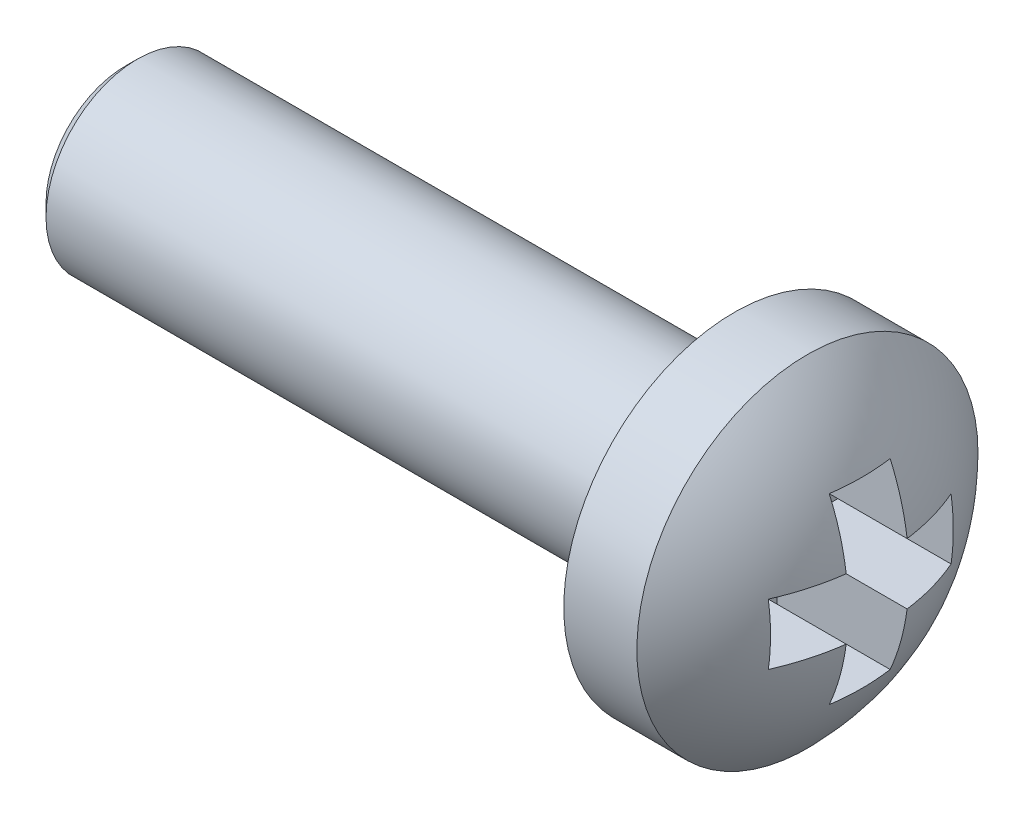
from build123d import *

# Parameters (mm, degrees)
CHANFREIN1_SIZE         = 0.2
ENL_V_START             = -2.4
ENL_V_MAT_EXTRU_1_DEPTH = 2.2


with BuildPart() as part:
    # Esquisse1 → R_volution1 (revolve)
    with BuildSketch(Plane.XY, mode=Mode.PRIVATE) as r_volution1_sk:
        with BuildLine():
            Line((0, 1.5), (0, 2.8))
            Line((0, 2.8), (1.2, 2.8))
            add(Edge.make_bspline(
                [(1.2, 2.8), (2.4, 1.571691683), (2.4, 0)],
                knots=[0, 0, 0, 1, 1, 1], degree=2))
            Line((2.4, 0), (-10, 0))
            Line((-10, 0), (-10, 1.5))
            Line((-10, 1.5), (0, 1.5))
        make_face()
    revolve(r_volution1_sk.sketch.rotate(Axis((11.061826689, 0, 0), (-1, 0, 0)), 90), axis=Axis((11.061826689, 0, 0), (-1, 0, 0)))

    # Chanfrein1
    chanfrein1_edges = [part.edges().sort_by_distance(p)[0] for p in [
        (-10, 0, 1.5),
    ]]
    chamfer(chanfrein1_edges, length=CHANFREIN1_SIZE)

    # Esquisse2 → Enl_v. mat.-Extru.1 (cut)
    with BuildSketch(Plane.ZY.offset(ENL_V_START)):
        Polygon((-0.5, 0.5), (-1.5, 0.5), (-1.5, -0.5), (-0.5, -0.5), (-0.5, -1.5), (0.5, -1.5), (0.5, -0.5), (1.5, -0.5), (1.5, 0.5), (0.5, 0.5), (0.5, 1.5), (-0.5, 1.5), align=None)
    extrude(amount=ENL_V_MAT_EXTRU_1_DEPTH, mode=Mode.SUBTRACT)


solid = part.part
